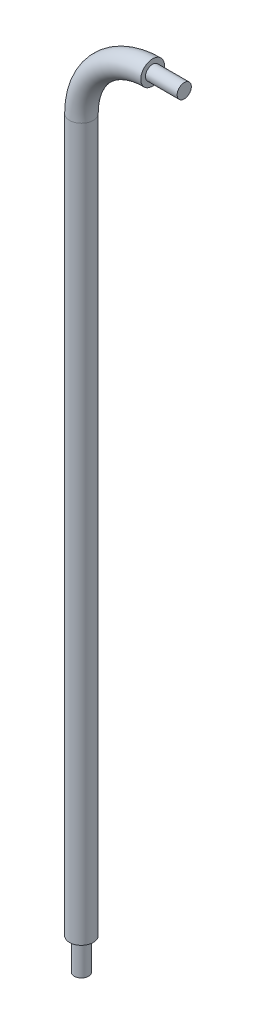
ISO-10303-21;
HEADER;
FILE_DESCRIPTION(('STEP AP214'),'2;1');
FILE_NAME('part.step','',(''),(''),'','','');
FILE_SCHEMA(('AUTOMOTIVE_DESIGN { 1 0 10303 214 1 1 1 1 }'));
ENDSEC;
DATA;
#1=APPLICATION_CONTEXT('core data for automotive mechanical design processes');
#2=APPLICATION_PROTOCOL_DEFINITION('international standard','automotive_design',2000,#1);
#3=PRODUCT_CONTEXT('',#1,'mechanical');
#4=PRODUCT('Part','Part','',(#3));
#5=PRODUCT_RELATED_PRODUCT_CATEGORY('part','',(#4));
#6=PRODUCT_DEFINITION_FORMATION('','',#4);
#7=PRODUCT_DEFINITION_CONTEXT('part definition',#1,'design');
#8=PRODUCT_DEFINITION('design','',#6,#7);
#9=PRODUCT_DEFINITION_SHAPE('','',#8);
#10=(LENGTH_UNIT() NAMED_UNIT(*) SI_UNIT(.MILLI.,.METRE.));
#11=(NAMED_UNIT(*) PLANE_ANGLE_UNIT() SI_UNIT($,.RADIAN.));
#12=(NAMED_UNIT(*) SI_UNIT($,.STERADIAN.) SOLID_ANGLE_UNIT());
#13=UNCERTAINTY_MEASURE_WITH_UNIT(LENGTH_MEASURE(1.E-05),#10,'distance_accuracy_value','');
#14=(GEOMETRIC_REPRESENTATION_CONTEXT(3) GLOBAL_UNCERTAINTY_ASSIGNED_CONTEXT((#13)) GLOBAL_UNIT_ASSIGNED_CONTEXT((#10,
#11,#12)) REPRESENTATION_CONTEXT('',''));
#15=CARTESIAN_POINT('',(0.,0.,0.));
#16=DIRECTION('',(0.,0.,1.));
#17=DIRECTION('',(1.,0.,0.));
#18=AXIS2_PLACEMENT_3D('',#15,#16,#17);
#19=CARTESIAN_POINT('',(4.5,49.5,0.));
#20=DIRECTION('',(1.,0.,0.));
#21=DIRECTION('',(0.,1.,0.));
#22=AXIS2_PLACEMENT_3D('',#19,#20,#21);
#23=PLANE('',#22);
#24=CARTESIAN_POINT('',(4.5,48.75,0.));
#25=CARTESIAN_POINT('',(4.5,48.7500034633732,0.0421035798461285));
#26=CARTESIAN_POINT('',(4.5,48.7535584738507,0.0842453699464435));
#27=CARTESIAN_POINT('',(4.5,48.7677014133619,0.167404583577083));
#28=CARTESIAN_POINT('',(4.5,48.7783043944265,0.208419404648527));
#29=CARTESIAN_POINT('',(4.5,48.8062373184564,0.288045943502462));
#30=CARTESIAN_POINT('',(4.5,48.8235599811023,0.326660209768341));
#31=CARTESIAN_POINT('',(4.5,48.8644426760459,0.400431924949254));
#32=CARTESIAN_POINT('',(4.5,48.8880028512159,0.435589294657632));
#33=CARTESIAN_POINT('',(4.5,48.9406898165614,0.501448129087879));
#34=CARTESIAN_POINT('',(4.5,48.9698163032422,0.532149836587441));
#35=CARTESIAN_POINT('',(4.5,49.0328127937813,0.588230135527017));
#36=CARTESIAN_POINT('',(4.5,49.0666832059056,0.613608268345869));
#37=CARTESIAN_POINT('',(4.5,49.1382026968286,0.658316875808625));
#38=CARTESIAN_POINT('',(4.5,49.1758516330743,0.677647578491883));
#39=CARTESIAN_POINT('',(4.5,49.2538600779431,0.709713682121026));
#40=CARTESIAN_POINT('',(4.5,49.2942195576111,0.722449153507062));
#41=CARTESIAN_POINT('',(4.5,49.3765039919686,0.740963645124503));
#42=CARTESIAN_POINT('',(4.5,49.4184289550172,0.746742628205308));
#43=CARTESIAN_POINT('',(4.5,49.5026540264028,0.751179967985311));
#44=CARTESIAN_POINT('',(4.5,49.5449541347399,0.749838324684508));
#45=CARTESIAN_POINT('',(4.5,49.6287284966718,0.740072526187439));
#46=CARTESIAN_POINT('',(4.5,49.6702027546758,0.731648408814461));
#47=CARTESIAN_POINT('',(4.5,49.7511487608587,0.707956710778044));
#48=CARTESIAN_POINT('',(4.5,49.7906204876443,0.692689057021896));
#49=CARTESIAN_POINT('',(4.5,49.8664418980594,0.655743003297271));
#50=CARTESIAN_POINT('',(4.5,49.9027914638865,0.634064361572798));
#51=CARTESIAN_POINT('',(4.5,49.971331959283,0.584913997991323));
#52=CARTESIAN_POINT('',(4.5,50.0035232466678,0.557442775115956));
#53=CARTESIAN_POINT('',(4.5,50.0628387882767,0.497484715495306));
#54=CARTESIAN_POINT('',(4.5,50.0899627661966,0.464997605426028));
#55=CARTESIAN_POINT('',(4.5,50.1383708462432,0.395930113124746));
#56=CARTESIAN_POINT('',(4.5,50.1596550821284,0.359349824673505));
#57=CARTESIAN_POINT('',(4.5,50.1958002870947,0.283099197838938));
#58=CARTESIAN_POINT('',(4.5,50.2106542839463,0.243425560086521));
#59=CARTESIAN_POINT('',(4.5,50.2334570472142,0.162212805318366));
#60=CARTESIAN_POINT('',(4.5,50.2414205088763,0.12067785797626));
#61=CARTESIAN_POINT('',(4.5,50.2486161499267,0.0526308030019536));
#62=CARTESIAN_POINT('',(4.5,50.2500021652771,0.0263228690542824));
#63=CARTESIAN_POINT('',(4.5,50.2499965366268,-0.042103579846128));
#64=CARTESIAN_POINT('',(4.5,50.2464415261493,-0.0842453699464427));
#65=CARTESIAN_POINT('',(4.5,50.2322985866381,-0.167404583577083));
#66=CARTESIAN_POINT('',(4.5,50.2216956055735,-0.208419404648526));
#67=CARTESIAN_POINT('',(4.5,50.1937626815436,-0.288045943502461));
#68=CARTESIAN_POINT('',(4.5,50.1764400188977,-0.326660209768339));
#69=CARTESIAN_POINT('',(4.5,50.1355573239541,-0.400431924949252));
#70=CARTESIAN_POINT('',(4.5,50.1119971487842,-0.435589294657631));
#71=CARTESIAN_POINT('',(4.5,50.0593101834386,-0.501448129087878));
#72=CARTESIAN_POINT('',(4.5,50.0301836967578,-0.532149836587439));
#73=CARTESIAN_POINT('',(4.5,49.9671872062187,-0.588230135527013));
#74=CARTESIAN_POINT('',(4.5,49.9333167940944,-0.613608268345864));
#75=CARTESIAN_POINT('',(4.5,49.8617973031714,-0.658316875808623));
#76=CARTESIAN_POINT('',(4.5,49.8241483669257,-0.677647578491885));
#77=CARTESIAN_POINT('',(4.5,49.7461399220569,-0.70971368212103));
#78=CARTESIAN_POINT('',(4.5,49.7057804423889,-0.722449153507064));
#79=CARTESIAN_POINT('',(4.5,49.6234960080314,-0.740963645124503));
#80=CARTESIAN_POINT('',(4.5,49.5815710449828,-0.746742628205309));
#81=CARTESIAN_POINT('',(4.5,49.4973459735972,-0.751179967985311));
#82=CARTESIAN_POINT('',(4.5,49.4550458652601,-0.749838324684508));
#83=CARTESIAN_POINT('',(4.5,49.3712715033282,-0.740072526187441));
#84=CARTESIAN_POINT('',(4.5,49.3297972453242,-0.731648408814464));
#85=CARTESIAN_POINT('',(4.5,49.2488512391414,-0.70795671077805));
#86=CARTESIAN_POINT('',(4.5,49.2093795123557,-0.6926890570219));
#87=CARTESIAN_POINT('',(4.5,49.1335581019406,-0.655743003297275));
#88=CARTESIAN_POINT('',(4.5,49.0972085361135,-0.634064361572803));
#89=CARTESIAN_POINT('',(4.5,49.028668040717,-0.584913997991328));
#90=CARTESIAN_POINT('',(4.5,48.9964767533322,-0.557442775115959));
#91=CARTESIAN_POINT('',(4.5,48.9371612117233,-0.497484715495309));
#92=CARTESIAN_POINT('',(4.5,48.9100372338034,-0.464997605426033));
#93=CARTESIAN_POINT('',(4.5,48.8616291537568,-0.395930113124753));
#94=CARTESIAN_POINT('',(4.5,48.8403449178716,-0.359349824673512));
#95=CARTESIAN_POINT('',(4.5,48.8041997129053,-0.283099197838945));
#96=CARTESIAN_POINT('',(4.5,48.7893457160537,-0.243425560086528));
#97=CARTESIAN_POINT('',(4.5,48.7665429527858,-0.162212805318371));
#98=CARTESIAN_POINT('',(4.5,48.7585794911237,-0.120677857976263));
#99=CARTESIAN_POINT('',(4.5,48.7513838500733,-0.052630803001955));
#100=CARTESIAN_POINT('',(4.5,48.7499978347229,-0.026322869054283));
#101=CARTESIAN_POINT('',(4.5,48.75,0.));
#102=B_SPLINE_CURVE_WITH_KNOTS('',3,(#24,#25,#26,#27,#28,#29,#30,#31,#32,#33,#34,#35,#36,#37,
#38,#39,#40,#41,#42,#43,#44,#45,#46,#47,#48,#49,#50,#51,#52,#53,#54,#55,#56,#57,#58,#59,#60,#61,
#62,#63,#64,#65,#66,#67,#68,#69,#70,#71,#72,#73,#74,#75,#76,#77,#78,#79,#80,#81,#82,#83,#84,#85,
#86,#87,#88,#89,#90,#91,#92,#93,#94,#95,#96,#97,#98,#99,#100,#101),.UNSPECIFIED.,.T.,.F.,(4,2,2,
2,2,2,2,2,2,2,2,2,2,2,2,2,2,2,2,2,2,2,2,2,2,2,2,2,2,2,2,2,2,2,2,2,2,2,4),(0.,0.126228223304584,
0.252726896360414,0.379088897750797,0.505453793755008,0.631811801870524,0.758180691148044,
0.884544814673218,1.01090758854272,1.13727103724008,1.26363448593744,1.38999725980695,
1.51636138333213,1.64273027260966,1.76908828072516,1.89545317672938,2.02181517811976,
2.14831385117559,2.27454207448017,2.35345909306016,2.47968731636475,2.60618598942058,
2.73254799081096,2.85891288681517,2.98527089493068,3.11163978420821,3.23800390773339,
3.3643666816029,3.49073013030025,3.6170935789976,3.7434563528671,3.86982047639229,
3.99618936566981,4.12254737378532,4.24891226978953,4.37527427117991,4.50177294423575,
4.62800116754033,4.70691818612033),.UNSPECIFIED.);
#103=CARTESIAN_POINT('',(4.5,48.75,0.));
#104=VERTEX_POINT('',#103);
#105=EDGE_CURVE('P0_E19',#104,#104,#102,.T.);
#106=ORIENTED_EDGE('',*,*,#105,.F.);
#107=EDGE_LOOP('',(#106));
#108=FACE_BOUND('',#107,.T.);
#109=ADVANCED_FACE('P0_F15',(#108),#23,.T.);
#110=CARTESIAN_POINT('',(4.5,45.,0.));
#111=DIRECTION('',(0.,0.,-1.));
#112=DIRECTION('',(-1.,0.,0.));
#113=AXIS2_PLACEMENT_3D('',#110,#111,#112);
#114=TOROIDAL_SURFACE('',#113,4.5,0.75);
#115=CARTESIAN_POINT('',(0.,45.,0.));
#116=DIRECTION('',(0.,-1.,0.));
#117=DIRECTION('',(0.,0.,-1.));
#118=AXIS2_PLACEMENT_3D('',#115,#116,#117);
#119=CIRCLE('',#118,0.75);
#120=CARTESIAN_POINT('',(0.,45.,-0.75));
#121=VERTEX_POINT('',#120);
#122=EDGE_CURVE('P0_E25',#121,#121,#119,.T.);
#123=ORIENTED_EDGE('',*,*,#122,.F.);
#124=EDGE_LOOP('',(#123));
#125=FACE_BOUND('',#124,.T.);
#126=ORIENTED_EDGE('',*,*,#105,.T.);
#127=EDGE_LOOP('',(#126));
#128=FACE_BOUND('',#127,.T.);
#129=ADVANCED_FACE('P0_F32',(#125,#128),#114,.T.);
#130=CARTESIAN_POINT('',(0.,0.,0.));
#131=DIRECTION('',(0.,1.,0.));
#132=DIRECTION('',(0.,0.,1.));
#133=AXIS2_PLACEMENT_3D('',#130,#131,#132);
#134=PLANE('',#133);
#135=CARTESIAN_POINT('',(0.,0.,0.));
#136=DIRECTION('',(0.,-1.,0.));
#137=DIRECTION('',(0.,0.,-1.));
#138=AXIS2_PLACEMENT_3D('',#135,#136,#137);
#139=CIRCLE('',#138,0.75);
#140=CARTESIAN_POINT('',(0.,0.,-0.75));
#141=VERTEX_POINT('',#140);
#142=EDGE_CURVE('P0_E10',#141,#141,#139,.F.);
#143=ORIENTED_EDGE('',*,*,#142,.F.);
#144=EDGE_LOOP('',(#143));
#145=FACE_BOUND('',#144,.T.);
#146=ADVANCED_FACE('P0_F36',(#145),#134,.F.);
#147=CARTESIAN_POINT('',(0.,45.,0.));
#148=DIRECTION('',(0.,-1.,0.));
#149=DIRECTION('',(0.,0.,-1.));
#150=AXIS2_PLACEMENT_3D('',#147,#148,#149);
#151=CYLINDRICAL_SURFACE('',#150,0.75);
#152=ORIENTED_EDGE('',*,*,#142,.T.);
#153=EDGE_LOOP('',(#152));
#154=FACE_BOUND('',#153,.T.);
#155=ORIENTED_EDGE('',*,*,#122,.T.);
#156=EDGE_LOOP('',(#155));
#157=FACE_BOUND('',#156,.T.);
#158=ADVANCED_FACE('P0_F40',(#154,#157),#151,.T.);
#159=CLOSED_SHELL('',(#109,#129,#146,#158));
#160=MANIFOLD_SOLID_BREP('P0_B1',#159);
#161=CARTESIAN_POINT('',(6.50000000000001,49.5,0.));
#162=DIRECTION('',(1.,0.,0.));
#163=DIRECTION('',(0.,1.,0.));
#164=AXIS2_PLACEMENT_3D('',#161,#162,#163);
#165=PLANE('',#164);
#166=CARTESIAN_POINT('',(6.50000000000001,49.5,0.));
#167=DIRECTION('',(-1.,0.,0.));
#168=DIRECTION('',(0.,-1.,0.));
#169=AXIS2_PLACEMENT_3D('',#166,#167,#168);
#170=CIRCLE('',#169,0.449999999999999);
#171=CARTESIAN_POINT('',(6.50000000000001,49.05,0.));
#172=VERTEX_POINT('',#171);
#173=EDGE_CURVE('P1_E18',#172,#172,#170,.T.);
#174=ORIENTED_EDGE('',*,*,#173,.F.);
#175=EDGE_LOOP('',(#174));
#176=FACE_BOUND('',#175,.T.);
#177=ADVANCED_FACE('P1_F15',(#176),#165,.T.);
#178=CARTESIAN_POINT('',(4.5,49.5,0.));
#179=DIRECTION('',(1.,0.,0.));
#180=DIRECTION('',(0.,1.,0.));
#181=AXIS2_PLACEMENT_3D('',#178,#179,#180);
#182=PLANE('',#181);
#183=CARTESIAN_POINT('',(4.5,49.5,0.));
#184=DIRECTION('',(-1.,0.,0.));
#185=DIRECTION('',(0.,-1.,0.));
#186=AXIS2_PLACEMENT_3D('',#183,#184,#185);
#187=CIRCLE('',#186,0.449999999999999);
#188=CARTESIAN_POINT('',(4.5,49.05,0.));
#189=VERTEX_POINT('',#188);
#190=EDGE_CURVE('P1_E10',#189,#189,#187,.F.);
#191=ORIENTED_EDGE('',*,*,#190,.F.);
#192=EDGE_LOOP('',(#191));
#193=FACE_BOUND('',#192,.T.);
#194=ADVANCED_FACE('P1_F30',(#193),#182,.F.);
#195=CARTESIAN_POINT('',(6.50000000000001,49.5,0.));
#196=DIRECTION('',(-1.,0.,0.));
#197=DIRECTION('',(0.,-1.,0.));
#198=AXIS2_PLACEMENT_3D('',#195,#196,#197);
#199=CYLINDRICAL_SURFACE('',#198,0.449999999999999);
#200=ORIENTED_EDGE('',*,*,#190,.T.);
#201=EDGE_LOOP('',(#200));
#202=FACE_BOUND('',#201,.T.);
#203=ORIENTED_EDGE('',*,*,#173,.T.);
#204=EDGE_LOOP('',(#203));
#205=FACE_BOUND('',#204,.T.);
#206=ADVANCED_FACE('P1_F27',(#202,#205),#199,.T.);
#207=CLOSED_SHELL('',(#177,#194,#206));
#208=MANIFOLD_SOLID_BREP('P1_B1',#207);
#209=CARTESIAN_POINT('',(0.,-2.,0.));
#210=DIRECTION('',(0.,-1.,0.));
#211=DIRECTION('',(0.,0.,-1.));
#212=AXIS2_PLACEMENT_3D('',#209,#210,#211);
#213=PLANE('',#212);
#214=CARTESIAN_POINT('',(0.,-2.,0.));
#215=DIRECTION('',(0.,1.,0.));
#216=DIRECTION('',(0.,0.,1.));
#217=AXIS2_PLACEMENT_3D('',#214,#215,#216);
#218=CIRCLE('',#217,0.45);
#219=CARTESIAN_POINT('',(0.,-2.,0.45));
#220=VERTEX_POINT('',#219);
#221=EDGE_CURVE('P2_E18',#220,#220,#218,.T.);
#222=ORIENTED_EDGE('',*,*,#221,.F.);
#223=EDGE_LOOP('',(#222));
#224=FACE_BOUND('',#223,.T.);
#225=ADVANCED_FACE('P2_F15',(#224),#213,.T.);
#226=CARTESIAN_POINT('',(0.,0.,0.));
#227=DIRECTION('',(0.,-1.,0.));
#228=DIRECTION('',(0.,0.,-1.));
#229=AXIS2_PLACEMENT_3D('',#226,#227,#228);
#230=PLANE('',#229);
#231=CARTESIAN_POINT('',(0.,0.,0.));
#232=DIRECTION('',(0.,1.,0.));
#233=DIRECTION('',(0.,0.,1.));
#234=AXIS2_PLACEMENT_3D('',#231,#232,#233);
#235=CIRCLE('',#234,0.45);
#236=CARTESIAN_POINT('',(0.,0.,0.45));
#237=VERTEX_POINT('',#236);
#238=EDGE_CURVE('P2_E10',#237,#237,#235,.F.);
#239=ORIENTED_EDGE('',*,*,#238,.F.);
#240=EDGE_LOOP('',(#239));
#241=FACE_BOUND('',#240,.T.);
#242=ADVANCED_FACE('P2_F30',(#241),#230,.F.);
#243=CARTESIAN_POINT('',(0.,-2.,0.));
#244=DIRECTION('',(0.,1.,0.));
#245=DIRECTION('',(0.,0.,1.));
#246=AXIS2_PLACEMENT_3D('',#243,#244,#245);
#247=CYLINDRICAL_SURFACE('',#246,0.45);
#248=ORIENTED_EDGE('',*,*,#238,.T.);
#249=EDGE_LOOP('',(#248));
#250=FACE_BOUND('',#249,.T.);
#251=ORIENTED_EDGE('',*,*,#221,.T.);
#252=EDGE_LOOP('',(#251));
#253=FACE_BOUND('',#252,.T.);
#254=ADVANCED_FACE('P2_F27',(#250,#253),#247,.T.);
#255=CLOSED_SHELL('',(#225,#242,#254));
#256=MANIFOLD_SOLID_BREP('P2_B1',#255);
#257=ADVANCED_BREP_SHAPE_REPRESENTATION('',(#18,#160,#208,#256),#14);
#258=SHAPE_DEFINITION_REPRESENTATION(#9,#257);
ENDSEC;
END-ISO-10303-21;
